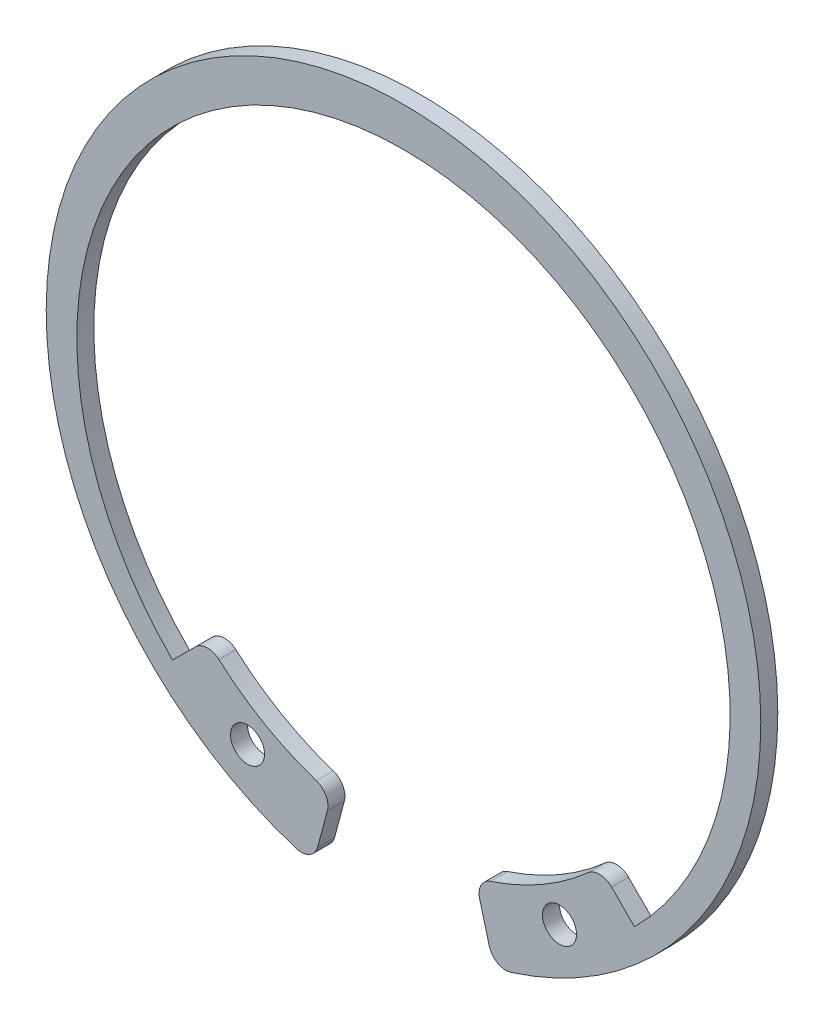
from build123d import *

# Parameters (mm, degrees)
ESQUISSE1_R          = 1
BASE_EXTRUSION_DEPTH = 1


with BuildPart() as part:
    # Esquisse1 → Base-Extrusion (new body)
    with BuildSketch(Plane.XY):
        with BuildLine():
            Line((5.046474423, -18.833698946), (4.474396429, -16.698674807))
            ThreePointArc((4.474396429, -16.698674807), (4.560215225, -15.965080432), (5.126154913, -15.49048814))
            ThreePointArc((5.126154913, -15.49048814), (8.158319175, -14.130623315), (10.85207879, -12.184624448))
            ThreePointArc((10.85207879, -12.184624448), (11.546057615, -11.931802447), (12.224278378, -12.224278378))
            Line((12.224278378, -12.224278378), (13.576450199, -13.576450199))
            ThreePointArc((13.576450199, -13.576450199), (0, 19.2), (-13.576450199, -13.576450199))
            Line((-13.576450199, -13.576450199), (-12.224278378, -12.224278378))
            ThreePointArc((-12.224278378, -12.224278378), (-11.546057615, -11.931802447), (-10.85207879, -12.184624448))
            ThreePointArc((-10.85207879, -12.184624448), (-8.158319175, -14.130623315), (-5.126154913, -15.49048814))
            ThreePointArc((-5.126154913, -15.49048814), (-4.560215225, -15.965080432), (-4.474396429, -16.698674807))
            Line((-4.474396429, -16.698674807), (-5.046474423, -18.833698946))
            ThreePointArc((-5.046474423, -18.833698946), (-5.531372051, -19.451585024), (-6.313020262, -19.528623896))
            ThreePointArc((-6.313020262, -19.528623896), (0, 21.5), (6.313020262, -19.528623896))
            ThreePointArc((6.313020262, -19.528623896), (5.531372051, -19.451585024), (5.046474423, -18.833698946))
        make_face()
        with Locations((-9.168442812, -15.671318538)):
            Circle(ESQUISSE1_R, mode=Mode.SUBTRACT)
        with Locations(Location((9.168442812, -15.671318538, 0), (0, 0, 180))):
            Circle(ESQUISSE1_R, mode=Mode.SUBTRACT)
    extrude(amount=BASE_EXTRUSION_DEPTH)


solid = part.part
